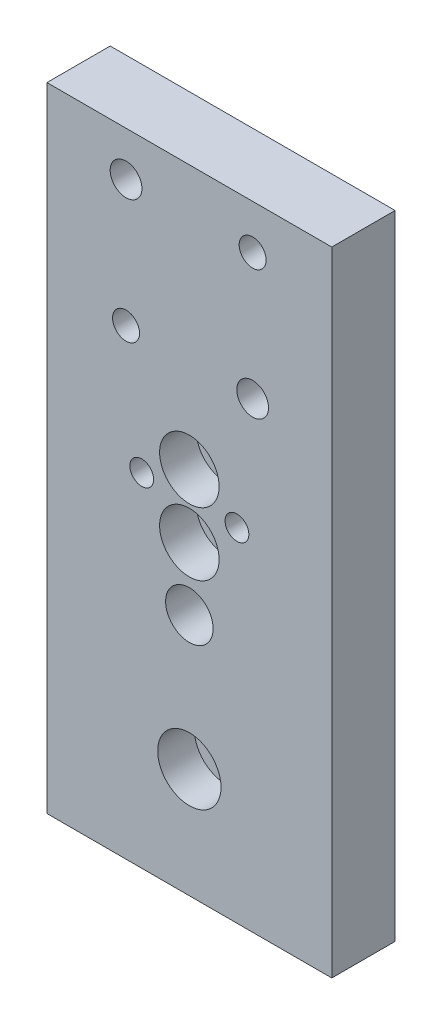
ISO-10303-21;
HEADER;
FILE_DESCRIPTION(('STEP AP214'),'2;1');
FILE_NAME('part.step','',(''),(''),'','','');
FILE_SCHEMA(('AUTOMOTIVE_DESIGN { 1 0 10303 214 1 1 1 1 }'));
ENDSEC;
DATA;
#1=APPLICATION_CONTEXT('core data for automotive mechanical design processes');
#2=APPLICATION_PROTOCOL_DEFINITION('international standard','automotive_design',2000,#1);
#3=PRODUCT_CONTEXT('',#1,'mechanical');
#4=PRODUCT('Part','Part','',(#3));
#5=PRODUCT_RELATED_PRODUCT_CATEGORY('part','',(#4));
#6=PRODUCT_DEFINITION_FORMATION('','',#4);
#7=PRODUCT_DEFINITION_CONTEXT('part definition',#1,'design');
#8=PRODUCT_DEFINITION('design','',#6,#7);
#9=PRODUCT_DEFINITION_SHAPE('','',#8);
#10=(LENGTH_UNIT() NAMED_UNIT(*) SI_UNIT(.MILLI.,.METRE.));
#11=(NAMED_UNIT(*) PLANE_ANGLE_UNIT() SI_UNIT($,.RADIAN.));
#12=(NAMED_UNIT(*) SI_UNIT($,.STERADIAN.) SOLID_ANGLE_UNIT());
#13=UNCERTAINTY_MEASURE_WITH_UNIT(LENGTH_MEASURE(1.E-05),#10,'distance_accuracy_value','');
#14=(GEOMETRIC_REPRESENTATION_CONTEXT(3) GLOBAL_UNCERTAINTY_ASSIGNED_CONTEXT((#13)) GLOBAL_UNIT_ASSIGNED_CONTEXT((#10,
#11,#12)) REPRESENTATION_CONTEXT('',''));
#15=CARTESIAN_POINT('',(0.,0.,0.));
#16=DIRECTION('',(0.,0.,1.));
#17=DIRECTION('',(1.,0.,0.));
#18=AXIS2_PLACEMENT_3D('',#15,#16,#17);
#19=CARTESIAN_POINT('',(-14.2875,-31.75,0.));
#20=DIRECTION('',(0.,0.,1.));
#21=DIRECTION('',(1.,0.,0.));
#22=AXIS2_PLACEMENT_3D('',#19,#20,#21);
#23=PLANE('',#22);
#24=CARTESIAN_POINT('',(6.35,27.305,0.));
#25=DIRECTION('',(0.,0.,-1.));
#26=DIRECTION('',(-1.,0.,0.));
#27=AXIS2_PLACEMENT_3D('',#24,#25,#26);
#28=CIRCLE('',#27,1.35255);
#29=CARTESIAN_POINT('',(4.99745,27.305,0.));
#30=VERTEX_POINT('',#29);
#31=EDGE_CURVE('E206',#30,#30,#28,.T.);
#32=ORIENTED_EDGE('',*,*,#31,.T.);
#33=EDGE_LOOP('',(#32));
#34=FACE_BOUND('',#33,.T.);
#35=DIRECTION('',(0.,-1.,0.));
#36=VECTOR('',#35,1.);
#37=CARTESIAN_POINT('',(-14.2875,31.75,0.));
#38=LINE('',#37,#36);
#39=CARTESIAN_POINT('',(-14.2875,31.75,0.));
#40=VERTEX_POINT('',#39);
#41=CARTESIAN_POINT('',(-14.2875,-31.75,0.));
#42=VERTEX_POINT('',#41);
#43=EDGE_CURVE('E104',#40,#42,#38,.T.);
#44=ORIENTED_EDGE('',*,*,#43,.T.);
#45=DIRECTION('',(1.,0.,0.));
#46=VECTOR('',#45,1.);
#47=CARTESIAN_POINT('',(-14.2875,-31.75,0.));
#48=LINE('',#47,#46);
#49=CARTESIAN_POINT('',(14.2875,-31.75,0.));
#50=VERTEX_POINT('',#49);
#51=EDGE_CURVE('E107',#42,#50,#48,.T.);
#52=ORIENTED_EDGE('',*,*,#51,.T.);
#53=DIRECTION('',(0.,1.,0.));
#54=VECTOR('',#53,1.);
#55=CARTESIAN_POINT('',(14.2875,31.75,0.));
#56=LINE('',#55,#54);
#57=CARTESIAN_POINT('',(14.2875,31.75,0.));
#58=VERTEX_POINT('',#57);
#59=EDGE_CURVE('E87',#50,#58,#56,.T.);
#60=ORIENTED_EDGE('',*,*,#59,.T.);
#61=DIRECTION('',(-1.,0.,0.));
#62=VECTOR('',#61,1.);
#63=CARTESIAN_POINT('',(-14.2875,31.75,0.));
#64=LINE('',#63,#62);
#65=EDGE_CURVE('E99',#58,#40,#64,.T.);
#66=ORIENTED_EDGE('',*,*,#65,.T.);
#67=EDGE_LOOP('',(#44,#52,#60,#66));
#68=FACE_BOUND('',#67,.T.);
#69=CARTESIAN_POINT('',(-6.35,27.305,0.));
#70=DIRECTION('',(0.,0.,1.));
#71=DIRECTION('',(1.,0.,0.));
#72=AXIS2_PLACEMENT_3D('',#69,#70,#71);
#73=CIRCLE('',#72,1.59385);
#74=CARTESIAN_POINT('',(-4.75615,27.305,0.));
#75=VERTEX_POINT('',#74);
#76=EDGE_CURVE('E165',#75,#75,#73,.T.);
#77=ORIENTED_EDGE('',*,*,#76,.F.);
#78=EDGE_LOOP('',(#77));
#79=FACE_BOUND('',#78,.T.);
#80=CARTESIAN_POINT('',(6.35,14.605,0.));
#81=DIRECTION('',(0.,0.,1.));
#82=DIRECTION('',(1.,0.,0.));
#83=AXIS2_PLACEMENT_3D('',#80,#81,#82);
#84=CIRCLE('',#83,1.59385);
#85=CARTESIAN_POINT('',(7.94385,14.605,0.));
#86=VERTEX_POINT('',#85);
#87=EDGE_CURVE('E161',#86,#86,#84,.T.);
#88=ORIENTED_EDGE('',*,*,#87,.F.);
#89=EDGE_LOOP('',(#88));
#90=FACE_BOUND('',#89,.T.);
#91=CARTESIAN_POINT('',(0.,-7.366,0.));
#92=DIRECTION('',(0.,0.,1.));
#93=DIRECTION('',(1.,0.,0.));
#94=AXIS2_PLACEMENT_3D('',#91,#92,#93);
#95=CIRCLE('',#94,2.38125);
#96=CARTESIAN_POINT('',(2.38125,-7.366,0.));
#97=VERTEX_POINT('',#96);
#98=EDGE_CURVE('E118',#97,#97,#95,.T.);
#99=ORIENTED_EDGE('',*,*,#98,.F.);
#100=EDGE_LOOP('',(#99));
#101=FACE_BOUND('',#100,.T.);
#102=CARTESIAN_POINT('',(0.,-20.7518,0.));
#103=DIRECTION('',(0.,0.,1.));
#104=DIRECTION('',(1.,0.,0.));
#105=AXIS2_PLACEMENT_3D('',#102,#103,#104);
#106=CIRCLE('',#105,3.175);
#107=CARTESIAN_POINT('',(3.175,-20.7518,0.));
#108=VERTEX_POINT('',#107);
#109=EDGE_CURVE('E122',#108,#108,#106,.T.);
#110=ORIENTED_EDGE('',*,*,#109,.F.);
#111=EDGE_LOOP('',(#110));
#112=FACE_BOUND('',#111,.T.);
#113=CARTESIAN_POINT('',(0.,-1.0668,0.));
#114=DIRECTION('',(0.,0.,1.));
#115=DIRECTION('',(1.,0.,0.));
#116=AXIS2_PLACEMENT_3D('',#113,#114,#115);
#117=CIRCLE('',#116,2.9845);
#118=CARTESIAN_POINT('',(2.9845,-1.0668,0.));
#119=VERTEX_POINT('',#118);
#120=EDGE_CURVE('E126',#119,#119,#117,.T.);
#121=ORIENTED_EDGE('',*,*,#120,.F.);
#122=EDGE_LOOP('',(#121));
#123=FACE_BOUND('',#122,.T.);
#124=CARTESIAN_POINT('',(0.,5.2832,0.));
#125=DIRECTION('',(0.,0.,1.));
#126=DIRECTION('',(1.,0.,0.));
#127=AXIS2_PLACEMENT_3D('',#124,#125,#126);
#128=CIRCLE('',#127,2.9845);
#129=CARTESIAN_POINT('',(2.9845,5.2832,0.));
#130=VERTEX_POINT('',#129);
#131=EDGE_CURVE('E133',#130,#130,#128,.T.);
#132=ORIENTED_EDGE('',*,*,#131,.F.);
#133=EDGE_LOOP('',(#132));
#134=FACE_BOUND('',#133,.T.);
#135=CARTESIAN_POINT('',(4.7752,2.6162,0.));
#136=DIRECTION('',(0.,0.,-1.));
#137=DIRECTION('',(-1.,0.,0.));
#138=AXIS2_PLACEMENT_3D('',#135,#136,#137);
#139=CIRCLE('',#138,1.1938);
#140=CARTESIAN_POINT('',(3.5814,2.6162,0.));
#141=VERTEX_POINT('',#140);
#142=EDGE_CURVE('E138',#141,#141,#139,.T.);
#143=ORIENTED_EDGE('',*,*,#142,.T.);
#144=EDGE_LOOP('',(#143));
#145=FACE_BOUND('',#144,.T.);
#146=CARTESIAN_POINT('',(-4.7752,2.6162,0.));
#147=DIRECTION('',(0.,0.,-1.));
#148=DIRECTION('',(-1.,0.,0.));
#149=AXIS2_PLACEMENT_3D('',#146,#147,#148);
#150=CIRCLE('',#149,1.1938);
#151=CARTESIAN_POINT('',(-5.969,2.6162,0.));
#152=VERTEX_POINT('',#151);
#153=EDGE_CURVE('E194',#152,#152,#150,.T.);
#154=ORIENTED_EDGE('',*,*,#153,.T.);
#155=EDGE_LOOP('',(#154));
#156=FACE_BOUND('',#155,.T.);
#157=CARTESIAN_POINT('',(-6.35,14.605,0.));
#158=DIRECTION('',(0.,0.,-1.));
#159=DIRECTION('',(-1.,0.,0.));
#160=AXIS2_PLACEMENT_3D('',#157,#158,#159);
#161=CIRCLE('',#160,1.35255);
#162=CARTESIAN_POINT('',(-7.70255,14.605,0.));
#163=VERTEX_POINT('',#162);
#164=EDGE_CURVE('E197',#163,#163,#161,.T.);
#165=ORIENTED_EDGE('',*,*,#164,.T.);
#166=EDGE_LOOP('',(#165));
#167=FACE_BOUND('',#166,.T.);
#168=ADVANCED_FACE('F35',(#34,#68,#79,#90,#101,#112,#123,#134,#145,#156,#167),#23,.T.);
#169=CARTESIAN_POINT('',(-14.2875,-31.75,-6.35));
#170=DIRECTION('',(0.,0.,1.));
#171=DIRECTION('',(1.,0.,0.));
#172=AXIS2_PLACEMENT_3D('',#169,#170,#171);
#173=PLANE('',#172);
#174=CARTESIAN_POINT('',(6.35,27.305,-6.35));
#175=DIRECTION('',(0.,0.,-1.));
#176=DIRECTION('',(-1.,0.,0.));
#177=AXIS2_PLACEMENT_3D('',#174,#175,#176);
#178=CIRCLE('',#177,1.35254999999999);
#179=CARTESIAN_POINT('',(4.99745000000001,27.305,-6.35));
#180=VERTEX_POINT('',#179);
#181=EDGE_CURVE('E200',#180,#180,#178,.T.);
#182=ORIENTED_EDGE('',*,*,#181,.F.);
#183=EDGE_LOOP('',(#182));
#184=FACE_BOUND('',#183,.T.);
#185=DIRECTION('',(0.,-1.,0.));
#186=VECTOR('',#185,1.);
#187=CARTESIAN_POINT('',(-14.2875,31.75,-6.35));
#188=LINE('',#187,#186);
#189=CARTESIAN_POINT('',(-14.2875,31.75,-6.35));
#190=VERTEX_POINT('',#189);
#191=CARTESIAN_POINT('',(-14.2875,-31.75,-6.35));
#192=VERTEX_POINT('',#191);
#193=EDGE_CURVE('E97',#190,#192,#188,.T.);
#194=ORIENTED_EDGE('',*,*,#193,.F.);
#195=DIRECTION('',(-1.,0.,0.));
#196=VECTOR('',#195,1.);
#197=CARTESIAN_POINT('',(-14.2875,31.75,-6.35));
#198=LINE('',#197,#196);
#199=CARTESIAN_POINT('',(14.2875,31.75,-6.35));
#200=VERTEX_POINT('',#199);
#201=EDGE_CURVE('E94',#200,#190,#198,.T.);
#202=ORIENTED_EDGE('',*,*,#201,.F.);
#203=DIRECTION('',(0.,1.,0.));
#204=VECTOR('',#203,1.);
#205=CARTESIAN_POINT('',(14.2875,31.75,-6.35));
#206=LINE('',#205,#204);
#207=CARTESIAN_POINT('',(14.2875,-31.75,-6.35));
#208=VERTEX_POINT('',#207);
#209=EDGE_CURVE('E85',#208,#200,#206,.T.);
#210=ORIENTED_EDGE('',*,*,#209,.F.);
#211=DIRECTION('',(1.,0.,0.));
#212=VECTOR('',#211,1.);
#213=CARTESIAN_POINT('',(-14.2875,-31.75,-6.35));
#214=LINE('',#213,#212);
#215=EDGE_CURVE('E93',#192,#208,#214,.T.);
#216=ORIENTED_EDGE('',*,*,#215,.F.);
#217=EDGE_LOOP('',(#194,#202,#210,#216));
#218=FACE_BOUND('',#217,.T.);
#219=CARTESIAN_POINT('',(-6.35,27.305,-6.35));
#220=DIRECTION('',(0.,0.,1.));
#221=DIRECTION('',(1.,0.,0.));
#222=AXIS2_PLACEMENT_3D('',#219,#220,#221);
#223=CIRCLE('',#222,1.59385);
#224=CARTESIAN_POINT('',(-4.75615,27.305,-6.35));
#225=VERTEX_POINT('',#224);
#226=EDGE_CURVE('E108',#225,#225,#223,.T.);
#227=ORIENTED_EDGE('',*,*,#226,.T.);
#228=EDGE_LOOP('',(#227));
#229=FACE_BOUND('',#228,.T.);
#230=CARTESIAN_POINT('',(6.35,14.605,-6.35));
#231=DIRECTION('',(0.,0.,1.));
#232=DIRECTION('',(1.,0.,0.));
#233=AXIS2_PLACEMENT_3D('',#230,#231,#232);
#234=CIRCLE('',#233,1.59385);
#235=CARTESIAN_POINT('',(7.94385,14.605,-6.35));
#236=VERTEX_POINT('',#235);
#237=EDGE_CURVE('E162',#236,#236,#234,.T.);
#238=ORIENTED_EDGE('',*,*,#237,.T.);
#239=EDGE_LOOP('',(#238));
#240=FACE_BOUND('',#239,.T.);
#241=CARTESIAN_POINT('',(0.,5.2832,-6.35));
#242=DIRECTION('',(0.,0.,1.));
#243=DIRECTION('',(1.,0.,0.));
#244=AXIS2_PLACEMENT_3D('',#241,#242,#243);
#245=CIRCLE('',#244,1.78562);
#246=CARTESIAN_POINT('',(1.78562,5.2832,-6.35));
#247=VERTEX_POINT('',#246);
#248=EDGE_CURVE('E158',#247,#247,#245,.T.);
#249=ORIENTED_EDGE('',*,*,#248,.T.);
#250=EDGE_LOOP('',(#249));
#251=FACE_BOUND('',#250,.T.);
#252=CARTESIAN_POINT('',(0.,-1.0668,-6.35));
#253=DIRECTION('',(0.,0.,1.));
#254=DIRECTION('',(1.,0.,0.));
#255=AXIS2_PLACEMENT_3D('',#252,#253,#254);
#256=CIRCLE('',#255,1.78562);
#257=CARTESIAN_POINT('',(1.78562,-1.0668,-6.35));
#258=VERTEX_POINT('',#257);
#259=EDGE_CURVE('E153',#258,#258,#256,.T.);
#260=ORIENTED_EDGE('',*,*,#259,.T.);
#261=EDGE_LOOP('',(#260));
#262=FACE_BOUND('',#261,.T.);
#263=CARTESIAN_POINT('',(0.,-7.366,-6.35));
#264=DIRECTION('',(0.,0.,1.));
#265=DIRECTION('',(1.,0.,0.));
#266=AXIS2_PLACEMENT_3D('',#263,#264,#265);
#267=CIRCLE('',#266,2.38125);
#268=CARTESIAN_POINT('',(2.38125,-7.366,-6.35));
#269=VERTEX_POINT('',#268);
#270=EDGE_CURVE('E150',#269,#269,#267,.T.);
#271=ORIENTED_EDGE('',*,*,#270,.T.);
#272=EDGE_LOOP('',(#271));
#273=FACE_BOUND('',#272,.T.);
#274=CARTESIAN_POINT('',(4.7752,2.6162,-6.35));
#275=DIRECTION('',(0.,0.,-1.));
#276=DIRECTION('',(-1.,0.,0.));
#277=AXIS2_PLACEMENT_3D('',#274,#275,#276);
#278=CIRCLE('',#277,1.1938);
#279=CARTESIAN_POINT('',(3.5814,2.6162,-6.35));
#280=VERTEX_POINT('',#279);
#281=EDGE_CURVE('E141',#280,#280,#278,.T.);
#282=ORIENTED_EDGE('',*,*,#281,.F.);
#283=EDGE_LOOP('',(#282));
#284=FACE_BOUND('',#283,.T.);
#285=CARTESIAN_POINT('',(-4.7752,2.6162,-6.35));
#286=DIRECTION('',(0.,0.,-1.));
#287=DIRECTION('',(-1.,0.,0.));
#288=AXIS2_PLACEMENT_3D('',#285,#286,#287);
#289=CIRCLE('',#288,1.1938);
#290=CARTESIAN_POINT('',(-5.969,2.6162,-6.35));
#291=VERTEX_POINT('',#290);
#292=EDGE_CURVE('E216',#291,#291,#289,.T.);
#293=ORIENTED_EDGE('',*,*,#292,.F.);
#294=EDGE_LOOP('',(#293));
#295=FACE_BOUND('',#294,.T.);
#296=CARTESIAN_POINT('',(0.,-20.7518,-6.35));
#297=DIRECTION('',(0.,0.,-1.));
#298=DIRECTION('',(-1.,0.,0.));
#299=AXIS2_PLACEMENT_3D('',#296,#297,#298);
#300=CIRCLE('',#299,3.302);
#301=CARTESIAN_POINT('',(-3.302,-20.7518,-6.35));
#302=VERTEX_POINT('',#301);
#303=EDGE_CURVE('E203',#302,#302,#300,.T.);
#304=ORIENTED_EDGE('',*,*,#303,.F.);
#305=EDGE_LOOP('',(#304));
#306=FACE_BOUND('',#305,.T.);
#307=CARTESIAN_POINT('',(-6.35,14.605,-6.35));
#308=DIRECTION('',(0.,0.,-1.));
#309=DIRECTION('',(-1.,0.,0.));
#310=AXIS2_PLACEMENT_3D('',#307,#308,#309);
#311=CIRCLE('',#310,1.35254999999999);
#312=CARTESIAN_POINT('',(-7.70254999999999,14.605,-6.35));
#313=VERTEX_POINT('',#312);
#314=EDGE_CURVE('E199',#313,#313,#311,.T.);
#315=ORIENTED_EDGE('',*,*,#314,.F.);
#316=EDGE_LOOP('',(#315));
#317=FACE_BOUND('',#316,.T.);
#318=ADVANCED_FACE('F91',(#184,#218,#229,#240,#251,#262,#273,#284,#295,#306,#317),#173,.F.);
#319=CARTESIAN_POINT('',(0.,-20.7518,-6.35));
#320=DIRECTION('',(0.,0.,1.));
#321=DIRECTION('',(1.,0.,0.));
#322=AXIS2_PLACEMENT_3D('',#319,#320,#321);
#323=CYLINDRICAL_SURFACE('',#322,1.8288);
#324=CARTESIAN_POINT('',(0.,-20.7518,-3.683));
#325=DIRECTION('',(0.,0.,1.));
#326=DIRECTION('',(1.,0.,0.));
#327=AXIS2_PLACEMENT_3D('',#324,#325,#326);
#328=CIRCLE('',#327,1.8288);
#329=CARTESIAN_POINT('',(1.8288,-20.7518,-3.683));
#330=VERTEX_POINT('',#329);
#331=EDGE_CURVE('E115',#330,#330,#328,.F.);
#332=ORIENTED_EDGE('',*,*,#331,.F.);
#333=EDGE_LOOP('',(#332));
#334=FACE_BOUND('',#333,.T.);
#335=CARTESIAN_POINT('',(0.,-20.7518,-5.08));
#336=DIRECTION('',(0.,0.,-1.));
#337=DIRECTION('',(-1.,0.,0.));
#338=AXIS2_PLACEMENT_3D('',#335,#336,#337);
#339=CIRCLE('',#338,1.8288);
#340=CARTESIAN_POINT('',(-1.8288,-20.7518,-5.08));
#341=VERTEX_POINT('',#340);
#342=EDGE_CURVE('E39',#341,#341,#339,.F.);
#343=ORIENTED_EDGE('',*,*,#342,.F.);
#344=EDGE_LOOP('',(#343));
#345=FACE_BOUND('',#344,.T.);
#346=ADVANCED_FACE('F225',(#334,#345),#323,.F.);
#347=CARTESIAN_POINT('',(0.,5.2832,-6.35));
#348=DIRECTION('',(0.,0.,1.));
#349=DIRECTION('',(1.,0.,0.));
#350=AXIS2_PLACEMENT_3D('',#347,#348,#349);
#351=CYLINDRICAL_SURFACE('',#350,1.78562);
#352=ORIENTED_EDGE('',*,*,#248,.F.);
#353=EDGE_LOOP('',(#352));
#354=FACE_BOUND('',#353,.T.);
#355=CARTESIAN_POINT('',(0.,5.2832,-3.683));
#356=DIRECTION('',(0.,0.,1.));
#357=DIRECTION('',(1.,0.,0.));
#358=AXIS2_PLACEMENT_3D('',#355,#356,#357);
#359=CIRCLE('',#358,1.78562);
#360=CARTESIAN_POINT('',(1.78562,5.2832,-3.683));
#361=VERTEX_POINT('',#360);
#362=EDGE_CURVE('E124',#361,#361,#359,.F.);
#363=ORIENTED_EDGE('',*,*,#362,.F.);
#364=EDGE_LOOP('',(#363));
#365=FACE_BOUND('',#364,.T.);
#366=ADVANCED_FACE('F285',(#354,#365),#351,.F.);
#367=CARTESIAN_POINT('',(0.,-1.0668,-6.35));
#368=DIRECTION('',(0.,0.,1.));
#369=DIRECTION('',(1.,0.,0.));
#370=AXIS2_PLACEMENT_3D('',#367,#368,#369);
#371=CYLINDRICAL_SURFACE('',#370,1.78562);
#372=ORIENTED_EDGE('',*,*,#259,.F.);
#373=EDGE_LOOP('',(#372));
#374=FACE_BOUND('',#373,.T.);
#375=CARTESIAN_POINT('',(0.,-1.0668,-3.683));
#376=DIRECTION('',(0.,0.,1.));
#377=DIRECTION('',(1.,0.,0.));
#378=AXIS2_PLACEMENT_3D('',#375,#376,#377);
#379=CIRCLE('',#378,1.78562);
#380=CARTESIAN_POINT('',(1.78562,-1.0668,-3.683));
#381=VERTEX_POINT('',#380);
#382=EDGE_CURVE('E120',#381,#381,#379,.F.);
#383=ORIENTED_EDGE('',*,*,#382,.F.);
#384=EDGE_LOOP('',(#383));
#385=FACE_BOUND('',#384,.T.);
#386=ADVANCED_FACE('F291',(#374,#385),#371,.F.);
#387=CARTESIAN_POINT('',(-14.2875,31.75,-6.35));
#388=DIRECTION('',(-1.,0.,0.));
#389=DIRECTION('',(0.,-1.,0.));
#390=AXIS2_PLACEMENT_3D('',#387,#388,#389);
#391=PLANE('',#390);
#392=ORIENTED_EDGE('',*,*,#43,.F.);
#393=DIRECTION('',(0.,0.,1.));
#394=VECTOR('',#393,1.);
#395=CARTESIAN_POINT('',(-14.2875,31.75,-6.35));
#396=LINE('',#395,#394);
#397=EDGE_CURVE('E11',#190,#40,#396,.T.);
#398=ORIENTED_EDGE('',*,*,#397,.F.);
#399=ORIENTED_EDGE('',*,*,#193,.T.);
#400=DIRECTION('',(0.,0.,1.));
#401=VECTOR('',#400,1.);
#402=CARTESIAN_POINT('',(-14.2875,-31.75,-6.35));
#403=LINE('',#402,#401);
#404=EDGE_CURVE('E79',#192,#42,#403,.T.);
#405=ORIENTED_EDGE('',*,*,#404,.T.);
#406=EDGE_LOOP('',(#392,#398,#399,#405));
#407=FACE_BOUND('',#406,.T.);
#408=ADVANCED_FACE('F37',(#407),#391,.T.);
#409=CARTESIAN_POINT('',(-14.2875,31.75,-6.35));
#410=DIRECTION('',(0.,1.,0.));
#411=DIRECTION('',(0.,0.,1.));
#412=AXIS2_PLACEMENT_3D('',#409,#410,#411);
#413=PLANE('',#412);
#414=ORIENTED_EDGE('',*,*,#65,.F.);
#415=DIRECTION('',(0.,0.,1.));
#416=VECTOR('',#415,1.);
#417=CARTESIAN_POINT('',(14.2875,31.75,-6.35));
#418=LINE('',#417,#416);
#419=EDGE_CURVE('E45',#200,#58,#418,.T.);
#420=ORIENTED_EDGE('',*,*,#419,.F.);
#421=ORIENTED_EDGE('',*,*,#201,.T.);
#422=ORIENTED_EDGE('',*,*,#397,.T.);
#423=EDGE_LOOP('',(#414,#420,#421,#422));
#424=FACE_BOUND('',#423,.T.);
#425=ADVANCED_FACE('F304',(#424),#413,.T.);
#426=CARTESIAN_POINT('',(14.2875,31.75,-6.35));
#427=DIRECTION('',(1.,0.,0.));
#428=DIRECTION('',(0.,1.,0.));
#429=AXIS2_PLACEMENT_3D('',#426,#427,#428);
#430=PLANE('',#429);
#431=ORIENTED_EDGE('',*,*,#59,.F.);
#432=DIRECTION('',(0.,0.,1.));
#433=VECTOR('',#432,1.);
#434=CARTESIAN_POINT('',(14.2875,-31.75,-6.35));
#435=LINE('',#434,#433);
#436=EDGE_CURVE('E82',#208,#50,#435,.T.);
#437=ORIENTED_EDGE('',*,*,#436,.F.);
#438=ORIENTED_EDGE('',*,*,#209,.T.);
#439=ORIENTED_EDGE('',*,*,#419,.T.);
#440=EDGE_LOOP('',(#431,#437,#438,#439));
#441=FACE_BOUND('',#440,.T.);
#442=ADVANCED_FACE('F84',(#441),#430,.T.);
#443=CARTESIAN_POINT('',(-14.2875,-31.75,-6.35));
#444=DIRECTION('',(0.,-1.,0.));
#445=DIRECTION('',(0.,0.,-1.));
#446=AXIS2_PLACEMENT_3D('',#443,#444,#445);
#447=PLANE('',#446);
#448=ORIENTED_EDGE('',*,*,#51,.F.);
#449=ORIENTED_EDGE('',*,*,#404,.F.);
#450=ORIENTED_EDGE('',*,*,#215,.T.);
#451=ORIENTED_EDGE('',*,*,#436,.T.);
#452=EDGE_LOOP('',(#448,#449,#450,#451));
#453=FACE_BOUND('',#452,.T.);
#454=ADVANCED_FACE('F96',(#453),#447,.T.);
#455=CARTESIAN_POINT('',(-6.35,27.305,-6.35));
#456=DIRECTION('',(0.,0.,1.));
#457=DIRECTION('',(1.,0.,0.));
#458=AXIS2_PLACEMENT_3D('',#455,#456,#457);
#459=CYLINDRICAL_SURFACE('',#458,1.59385);
#460=ORIENTED_EDGE('',*,*,#226,.F.);
#461=EDGE_LOOP('',(#460));
#462=FACE_BOUND('',#461,.T.);
#463=ORIENTED_EDGE('',*,*,#76,.T.);
#464=EDGE_LOOP('',(#463));
#465=FACE_BOUND('',#464,.T.);
#466=ADVANCED_FACE('F172',(#462,#465),#459,.F.);
#467=CARTESIAN_POINT('',(6.35,14.605,-6.35));
#468=DIRECTION('',(0.,0.,1.));
#469=DIRECTION('',(1.,0.,0.));
#470=AXIS2_PLACEMENT_3D('',#467,#468,#469);
#471=CYLINDRICAL_SURFACE('',#470,1.59385);
#472=ORIENTED_EDGE('',*,*,#237,.F.);
#473=EDGE_LOOP('',(#472));
#474=FACE_BOUND('',#473,.T.);
#475=ORIENTED_EDGE('',*,*,#87,.T.);
#476=EDGE_LOOP('',(#475));
#477=FACE_BOUND('',#476,.T.);
#478=ADVANCED_FACE('F289',(#474,#477),#471,.F.);
#479=CARTESIAN_POINT('',(0.,-7.366,-6.35));
#480=DIRECTION('',(0.,0.,1.));
#481=DIRECTION('',(1.,0.,0.));
#482=AXIS2_PLACEMENT_3D('',#479,#480,#481);
#483=CYLINDRICAL_SURFACE('',#482,2.38125);
#484=ORIENTED_EDGE('',*,*,#270,.F.);
#485=EDGE_LOOP('',(#484));
#486=FACE_BOUND('',#485,.T.);
#487=ORIENTED_EDGE('',*,*,#98,.T.);
#488=EDGE_LOOP('',(#487));
#489=FACE_BOUND('',#488,.T.);
#490=ADVANCED_FACE('F278',(#486,#489),#483,.F.);
#491=CARTESIAN_POINT('',(0.,-20.7518,-3.683));
#492=DIRECTION('',(0.,0.,1.));
#493=DIRECTION('',(1.,0.,0.));
#494=AXIS2_PLACEMENT_3D('',#491,#492,#493);
#495=PLANE('',#494);
#496=CARTESIAN_POINT('',(0.,-20.7518,-3.683));
#497=DIRECTION('',(0.,0.,1.));
#498=DIRECTION('',(1.,0.,0.));
#499=AXIS2_PLACEMENT_3D('',#496,#497,#498);
#500=CIRCLE('',#499,3.175);
#501=CARTESIAN_POINT('',(3.175,-20.7518,-3.683));
#502=VERTEX_POINT('',#501);
#503=EDGE_CURVE('E119',#502,#502,#500,.T.);
#504=ORIENTED_EDGE('',*,*,#503,.T.);
#505=EDGE_LOOP('',(#504));
#506=FACE_BOUND('',#505,.T.);
#507=ORIENTED_EDGE('',*,*,#331,.T.);
#508=EDGE_LOOP('',(#507));
#509=FACE_BOUND('',#508,.T.);
#510=ADVANCED_FACE('F275',(#506,#509),#495,.T.);
#511=CARTESIAN_POINT('',(0.,-20.7518,-3.683));
#512=DIRECTION('',(0.,0.,1.));
#513=DIRECTION('',(1.,0.,0.));
#514=AXIS2_PLACEMENT_3D('',#511,#512,#513);
#515=CYLINDRICAL_SURFACE('',#514,3.175);
#516=ORIENTED_EDGE('',*,*,#503,.F.);
#517=EDGE_LOOP('',(#516));
#518=FACE_BOUND('',#517,.T.);
#519=ORIENTED_EDGE('',*,*,#109,.T.);
#520=EDGE_LOOP('',(#519));
#521=FACE_BOUND('',#520,.T.);
#522=ADVANCED_FACE('F270',(#518,#521),#515,.F.);
#523=CARTESIAN_POINT('',(0.,-1.0668,-3.683));
#524=DIRECTION('',(0.,0.,1.));
#525=DIRECTION('',(1.,0.,0.));
#526=AXIS2_PLACEMENT_3D('',#523,#524,#525);
#527=PLANE('',#526);
#528=CARTESIAN_POINT('',(0.,-1.0668,-3.683));
#529=DIRECTION('',(0.,0.,1.));
#530=DIRECTION('',(1.,0.,0.));
#531=AXIS2_PLACEMENT_3D('',#528,#529,#530);
#532=CIRCLE('',#531,2.9845);
#533=CARTESIAN_POINT('',(2.9845,-1.0668,-3.683));
#534=VERTEX_POINT('',#533);
#535=EDGE_CURVE('E123',#534,#534,#532,.T.);
#536=ORIENTED_EDGE('',*,*,#535,.T.);
#537=EDGE_LOOP('',(#536));
#538=FACE_BOUND('',#537,.T.);
#539=ORIENTED_EDGE('',*,*,#382,.T.);
#540=EDGE_LOOP('',(#539));
#541=FACE_BOUND('',#540,.T.);
#542=ADVANCED_FACE('F267',(#538,#541),#527,.T.);
#543=CARTESIAN_POINT('',(0.,-1.0668,-3.683));
#544=DIRECTION('',(0.,0.,1.));
#545=DIRECTION('',(1.,0.,0.));
#546=AXIS2_PLACEMENT_3D('',#543,#544,#545);
#547=CYLINDRICAL_SURFACE('',#546,2.9845);
#548=ORIENTED_EDGE('',*,*,#535,.F.);
#549=EDGE_LOOP('',(#548));
#550=FACE_BOUND('',#549,.T.);
#551=ORIENTED_EDGE('',*,*,#120,.T.);
#552=EDGE_LOOP('',(#551));
#553=FACE_BOUND('',#552,.T.);
#554=ADVANCED_FACE('F263',(#550,#553),#547,.F.);
#555=CARTESIAN_POINT('',(0.,5.2832,-3.683));
#556=DIRECTION('',(0.,0.,1.));
#557=DIRECTION('',(1.,0.,0.));
#558=AXIS2_PLACEMENT_3D('',#555,#556,#557);
#559=PLANE('',#558);
#560=CARTESIAN_POINT('',(0.,5.2832,-3.683));
#561=DIRECTION('',(0.,0.,1.));
#562=DIRECTION('',(1.,0.,0.));
#563=AXIS2_PLACEMENT_3D('',#560,#561,#562);
#564=CIRCLE('',#563,2.9845);
#565=CARTESIAN_POINT('',(2.9845,5.2832,-3.683));
#566=VERTEX_POINT('',#565);
#567=EDGE_CURVE('E127',#566,#566,#564,.T.);
#568=ORIENTED_EDGE('',*,*,#567,.T.);
#569=EDGE_LOOP('',(#568));
#570=FACE_BOUND('',#569,.T.);
#571=ORIENTED_EDGE('',*,*,#362,.T.);
#572=EDGE_LOOP('',(#571));
#573=FACE_BOUND('',#572,.T.);
#574=ADVANCED_FACE('F260',(#570,#573),#559,.T.);
#575=CARTESIAN_POINT('',(0.,5.2832,-3.683));
#576=DIRECTION('',(0.,0.,1.));
#577=DIRECTION('',(1.,0.,0.));
#578=AXIS2_PLACEMENT_3D('',#575,#576,#577);
#579=CYLINDRICAL_SURFACE('',#578,2.9845);
#580=ORIENTED_EDGE('',*,*,#567,.F.);
#581=EDGE_LOOP('',(#580));
#582=FACE_BOUND('',#581,.T.);
#583=ORIENTED_EDGE('',*,*,#131,.T.);
#584=EDGE_LOOP('',(#583));
#585=FACE_BOUND('',#584,.T.);
#586=ADVANCED_FACE('F258',(#582,#585),#579,.F.);
#587=CARTESIAN_POINT('',(4.7752,2.6162,0.));
#588=DIRECTION('',(0.,0.,-1.));
#589=DIRECTION('',(-1.,0.,0.));
#590=AXIS2_PLACEMENT_3D('',#587,#588,#589);
#591=CYLINDRICAL_SURFACE('',#590,1.1938);
#592=ORIENTED_EDGE('',*,*,#142,.F.);
#593=EDGE_LOOP('',(#592));
#594=FACE_BOUND('',#593,.T.);
#595=ORIENTED_EDGE('',*,*,#281,.T.);
#596=EDGE_LOOP('',(#595));
#597=FACE_BOUND('',#596,.T.);
#598=ADVANCED_FACE('F221',(#594,#597),#591,.F.);
#599=CARTESIAN_POINT('',(-4.7752,2.6162,0.));
#600=DIRECTION('',(0.,0.,-1.));
#601=DIRECTION('',(-1.,0.,0.));
#602=AXIS2_PLACEMENT_3D('',#599,#600,#601);
#603=CYLINDRICAL_SURFACE('',#602,1.1938);
#604=ORIENTED_EDGE('',*,*,#153,.F.);
#605=EDGE_LOOP('',(#604));
#606=FACE_BOUND('',#605,.T.);
#607=ORIENTED_EDGE('',*,*,#292,.T.);
#608=EDGE_LOOP('',(#607));
#609=FACE_BOUND('',#608,.T.);
#610=ADVANCED_FACE('F250',(#606,#609),#603,.F.);
#611=CARTESIAN_POINT('',(0.,-20.7518,-5.08));
#612=DIRECTION('',(0.,0.,-1.));
#613=DIRECTION('',(-1.,0.,0.));
#614=AXIS2_PLACEMENT_3D('',#611,#612,#613);
#615=PLANE('',#614);
#616=CARTESIAN_POINT('',(0.,-20.7518,-5.08));
#617=DIRECTION('',(0.,0.,-1.));
#618=DIRECTION('',(-1.,0.,0.));
#619=AXIS2_PLACEMENT_3D('',#616,#617,#618);
#620=CIRCLE('',#619,3.302);
#621=CARTESIAN_POINT('',(-3.302,-20.7518,-5.08));
#622=VERTEX_POINT('',#621);
#623=EDGE_CURVE('E210',#622,#622,#620,.T.);
#624=ORIENTED_EDGE('',*,*,#623,.T.);
#625=EDGE_LOOP('',(#624));
#626=FACE_BOUND('',#625,.T.);
#627=ORIENTED_EDGE('',*,*,#342,.T.);
#628=EDGE_LOOP('',(#627));
#629=FACE_BOUND('',#628,.T.);
#630=ADVANCED_FACE('F245',(#626,#629),#615,.T.);
#631=CARTESIAN_POINT('',(0.,-20.7518,-5.08));
#632=DIRECTION('',(0.,0.,-1.));
#633=DIRECTION('',(-1.,0.,0.));
#634=AXIS2_PLACEMENT_3D('',#631,#632,#633);
#635=CYLINDRICAL_SURFACE('',#634,3.302);
#636=ORIENTED_EDGE('',*,*,#623,.F.);
#637=EDGE_LOOP('',(#636));
#638=FACE_BOUND('',#637,.T.);
#639=ORIENTED_EDGE('',*,*,#303,.T.);
#640=EDGE_LOOP('',(#639));
#641=FACE_BOUND('',#640,.T.);
#642=ADVANCED_FACE('F237',(#638,#641),#635,.F.);
#643=CARTESIAN_POINT('',(-6.35,14.605,-6.35));
#644=DIRECTION('',(0.,0.,-1.));
#645=DIRECTION('',(-1.,0.,0.));
#646=AXIS2_PLACEMENT_3D('',#643,#644,#645);
#647=CYLINDRICAL_SURFACE('',#646,1.35254999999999);
#648=ORIENTED_EDGE('',*,*,#164,.F.);
#649=EDGE_LOOP('',(#648));
#650=FACE_BOUND('',#649,.T.);
#651=ORIENTED_EDGE('',*,*,#314,.T.);
#652=EDGE_LOOP('',(#651));
#653=FACE_BOUND('',#652,.T.);
#654=ADVANCED_FACE('F234',(#650,#653),#647,.F.);
#655=CARTESIAN_POINT('',(6.35,27.305,-6.35));
#656=DIRECTION('',(0.,0.,-1.));
#657=DIRECTION('',(-1.,0.,0.));
#658=AXIS2_PLACEMENT_3D('',#655,#656,#657);
#659=CYLINDRICAL_SURFACE('',#658,1.35254999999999);
#660=ORIENTED_EDGE('',*,*,#31,.F.);
#661=EDGE_LOOP('',(#660));
#662=FACE_BOUND('',#661,.T.);
#663=ORIENTED_EDGE('',*,*,#181,.T.);
#664=EDGE_LOOP('',(#663));
#665=FACE_BOUND('',#664,.T.);
#666=ADVANCED_FACE('F236',(#662,#665),#659,.F.);
#667=CLOSED_SHELL('',(#168,#318,#346,#366,#386,#408,#425,#442,#454,#466,#478,#490,#510,#522,
#542,#554,#574,#586,#598,#610,#630,#642,#654,#666));
#668=MANIFOLD_SOLID_BREP('B2',#667);
#669=ADVANCED_BREP_SHAPE_REPRESENTATION('',(#18,#668),#14);
#670=SHAPE_DEFINITION_REPRESENTATION(#9,#669);
ENDSEC;
END-ISO-10303-21;
